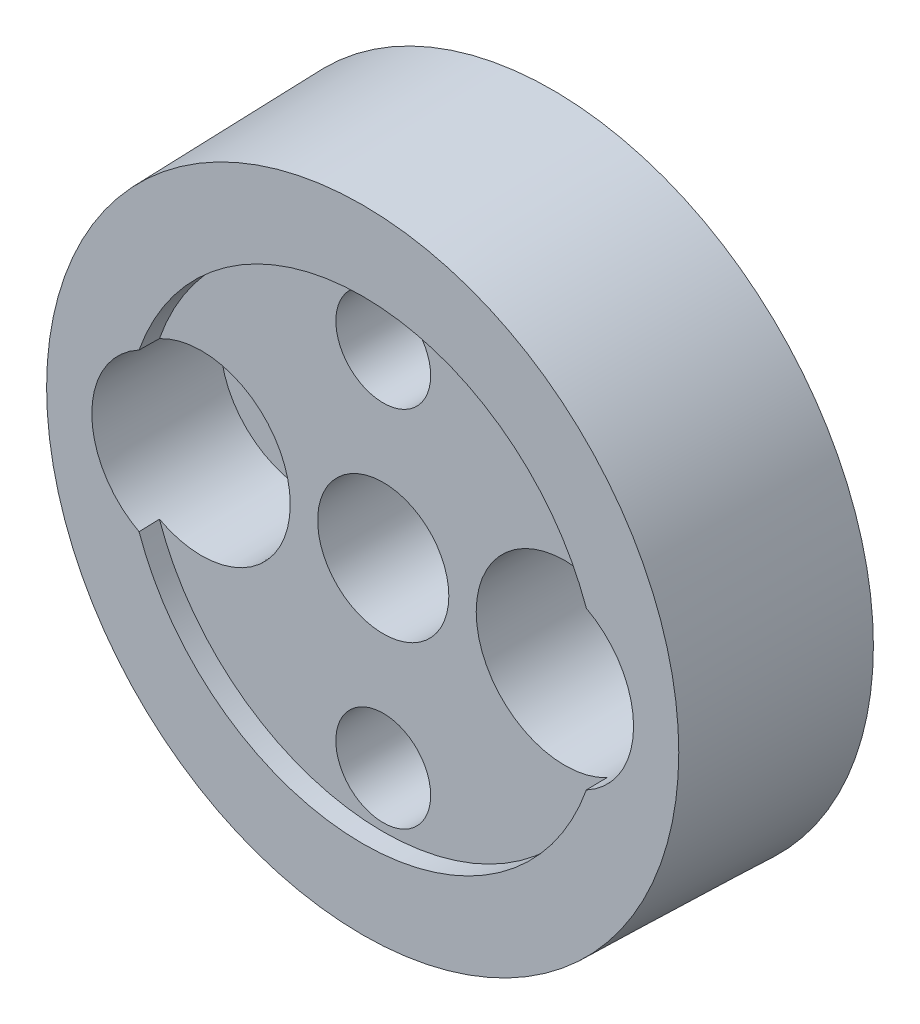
ISO-10303-21;
HEADER;
FILE_DESCRIPTION(('STEP AP214'),'2;1');
FILE_NAME('part.step','',(''),(''),'','','');
FILE_SCHEMA(('AUTOMOTIVE_DESIGN { 1 0 10303 214 1 1 1 1 }'));
ENDSEC;
DATA;
#1=APPLICATION_CONTEXT('core data for automotive mechanical design processes');
#2=APPLICATION_PROTOCOL_DEFINITION('international standard','automotive_design',2000,#1);
#3=PRODUCT_CONTEXT('',#1,'mechanical');
#4=PRODUCT('Part','Part','',(#3));
#5=PRODUCT_RELATED_PRODUCT_CATEGORY('part','',(#4));
#6=PRODUCT_DEFINITION_FORMATION('','',#4);
#7=PRODUCT_DEFINITION_CONTEXT('part definition',#1,'design');
#8=PRODUCT_DEFINITION('design','',#6,#7);
#9=PRODUCT_DEFINITION_SHAPE('','',#8);
#10=(LENGTH_UNIT() NAMED_UNIT(*) SI_UNIT(.MILLI.,.METRE.));
#11=(NAMED_UNIT(*) PLANE_ANGLE_UNIT() SI_UNIT($,.RADIAN.));
#12=(NAMED_UNIT(*) SI_UNIT($,.STERADIAN.) SOLID_ANGLE_UNIT());
#13=UNCERTAINTY_MEASURE_WITH_UNIT(LENGTH_MEASURE(1.E-05),#10,'distance_accuracy_value','');
#14=(GEOMETRIC_REPRESENTATION_CONTEXT(3) GLOBAL_UNCERTAINTY_ASSIGNED_CONTEXT((#13)) GLOBAL_UNIT_ASSIGNED_CONTEXT((#10,
#11,#12)) REPRESENTATION_CONTEXT('',''));
#15=CARTESIAN_POINT('',(0.,0.,0.));
#16=DIRECTION('',(0.,0.,1.));
#17=DIRECTION('',(1.,0.,0.));
#18=AXIS2_PLACEMENT_3D('',#15,#16,#17);
#19=CARTESIAN_POINT('',(0.,0.,12.));
#20=DIRECTION('',(0.,0.,1.));
#21=DIRECTION('',(1.,0.,0.));
#22=AXIS2_PLACEMENT_3D('',#19,#20,#21);
#23=CYLINDRICAL_SURFACE('',#22,15.);
#24=CARTESIAN_POINT('',(0.,0.,12.));
#25=DIRECTION('',(0.,0.,1.));
#26=DIRECTION('',(1.,0.,0.));
#27=AXIS2_PLACEMENT_3D('',#24,#25,#26);
#28=CIRCLE('',#27,15.);
#29=CARTESIAN_POINT('',(-14.1497589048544,-4.97838557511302,12.));
#30=VERTEX_POINT('',#29);
#31=CARTESIAN_POINT('',(14.1497589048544,-4.97838557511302,12.));
#32=VERTEX_POINT('',#31);
#33=EDGE_CURVE('E59',#30,#32,#28,.T.);
#34=ORIENTED_EDGE('',*,*,#33,.T.);
#35=CARTESIAN_POINT('',(14.14970155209,-4.97854858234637,12.0067));
#36=CARTESIAN_POINT('',(14.1515753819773,-4.97322292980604,11.7877998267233));
#37=CARTESIAN_POINT('',(14.1534473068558,-4.9678930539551,11.5688997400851));
#38=CARTESIAN_POINT('',(14.1571873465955,-4.95722485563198,11.1310997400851));
#39=CARTESIAN_POINT('',(14.1590554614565,-4.95188653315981,10.9121998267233));
#40=CARTESIAN_POINT('',(14.1609216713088,-4.94654398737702,10.6933));
#41=B_SPLINE_CURVE_WITH_KNOTS('',3,(#35,#36,#37,#38,#39,#40),.UNSPECIFIED.,.F.,.F.,(4,2,4),(0.,
0.656918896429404,1.31383779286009),.UNSPECIFIED.);
#42=CARTESIAN_POINT('',(14.1608645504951,-4.94670750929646,10.7));
#43=VERTEX_POINT('',#42);
#44=EDGE_CURVE('E68',#32,#43,#41,.T.);
#45=ORIENTED_EDGE('',*,*,#44,.T.);
#46=CARTESIAN_POINT('',(0.,0.,10.7));
#47=DIRECTION('',(0.,0.,1.));
#48=DIRECTION('',(1.,0.,0.));
#49=AXIS2_PLACEMENT_3D('',#46,#47,#48);
#50=CIRCLE('',#49,15.);
#51=CARTESIAN_POINT('',(-14.1608645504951,-4.94670750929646,10.7));
#52=VERTEX_POINT('',#51);
#53=EDGE_CURVE('E58',#52,#43,#50,.T.);
#54=ORIENTED_EDGE('',*,*,#53,.F.);
#55=CARTESIAN_POINT('',(-14.1609216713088,-4.94654398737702,10.6933));
#56=CARTESIAN_POINT('',(-14.1590554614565,-4.95188653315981,10.9121998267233));
#57=CARTESIAN_POINT('',(-14.1571873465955,-4.95722485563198,11.1310997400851));
#58=CARTESIAN_POINT('',(-14.1534473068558,-4.9678930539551,11.5688997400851));
#59=CARTESIAN_POINT('',(-14.1515753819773,-4.97322292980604,11.7877998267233));
#60=CARTESIAN_POINT('',(-14.14970155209,-4.97854858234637,12.0067));
#61=B_SPLINE_CURVE_WITH_KNOTS('',3,(#55,#56,#57,#58,#59,#60),.UNSPECIFIED.,.F.,.F.,(4,2,4),(0.,
0.656918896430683,1.31383779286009),.UNSPECIFIED.);
#62=EDGE_CURVE('E115',#52,#30,#61,.T.);
#63=ORIENTED_EDGE('',*,*,#62,.T.);
#64=EDGE_LOOP('',(#34,#45,#54,#63));
#65=FACE_BOUND('',#64,.T.);
#66=ADVANCED_FACE('F14',(#65),#23,.F.);
#67=CARTESIAN_POINT('',(14.1497589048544,4.97838557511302,12.));
#68=VERTEX_POINT('',#67);
#69=CARTESIAN_POINT('',(-14.1497589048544,4.97838557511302,12.));
#70=VERTEX_POINT('',#69);
#71=EDGE_CURVE('E51',#68,#70,#28,.T.);
#72=ORIENTED_EDGE('',*,*,#71,.T.);
#73=CARTESIAN_POINT('',(-14.14970155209,4.97854858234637,12.0067));
#74=CARTESIAN_POINT('',(-14.1515753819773,4.97322292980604,11.7877998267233));
#75=CARTESIAN_POINT('',(-14.1534473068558,4.9678930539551,11.5688997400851));
#76=CARTESIAN_POINT('',(-14.1571873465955,4.95722485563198,11.1310997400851));
#77=CARTESIAN_POINT('',(-14.1590554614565,4.95188653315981,10.9121998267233));
#78=CARTESIAN_POINT('',(-14.1609216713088,4.94654398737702,10.6933));
#79=B_SPLINE_CURVE_WITH_KNOTS('',3,(#73,#74,#75,#76,#77,#78),.UNSPECIFIED.,.F.,.F.,(4,2,4),(0.,
0.656918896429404,1.31383779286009),.UNSPECIFIED.);
#80=CARTESIAN_POINT('',(-14.1608645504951,4.94670750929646,10.7));
#81=VERTEX_POINT('',#80);
#82=EDGE_CURVE('E29',#70,#81,#79,.T.);
#83=ORIENTED_EDGE('',*,*,#82,.T.);
#84=CARTESIAN_POINT('',(14.1608645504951,4.94670750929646,10.7));
#85=VERTEX_POINT('',#84);
#86=EDGE_CURVE('E72',#85,#81,#50,.T.);
#87=ORIENTED_EDGE('',*,*,#86,.F.);
#88=CARTESIAN_POINT('',(14.1609216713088,4.94654398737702,10.6933));
#89=CARTESIAN_POINT('',(14.1590554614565,4.95188653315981,10.9121998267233));
#90=CARTESIAN_POINT('',(14.1571873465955,4.95722485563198,11.1310997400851));
#91=CARTESIAN_POINT('',(14.1534473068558,4.9678930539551,11.5688997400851));
#92=CARTESIAN_POINT('',(14.1515753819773,4.97322292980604,11.7877998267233));
#93=CARTESIAN_POINT('',(14.14970155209,4.97854858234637,12.0067));
#94=B_SPLINE_CURVE_WITH_KNOTS('',3,(#88,#89,#90,#91,#92,#93),.UNSPECIFIED.,.F.,.F.,(4,2,4),(0.,
0.656918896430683,1.31383779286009),.UNSPECIFIED.);
#95=EDGE_CURVE('E65',#85,#68,#94,.T.);
#96=ORIENTED_EDGE('',*,*,#95,.T.);
#97=EDGE_LOOP('',(#72,#83,#87,#96));
#98=FACE_BOUND('',#97,.T.);
#99=ADVANCED_FACE('F70',(#98),#23,.F.);
#100=CARTESIAN_POINT('',(0.,20.3142310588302,0.));
#101=DIRECTION('',(0.,0.,-1.));
#102=DIRECTION('',(-1.,0.,0.));
#103=AXIS2_PLACEMENT_3D('',#100,#101,#102);
#104=PLANE('',#103);
#105=CARTESIAN_POINT('',(0.,0.,0.));
#106=DIRECTION('',(0.,0.,1.));
#107=DIRECTION('',(1.,0.,0.));
#108=AXIS2_PLACEMENT_3D('',#105,#106,#107);
#109=CIRCLE('',#108,4.15);
#110=CARTESIAN_POINT('',(4.15,0.,0.));
#111=VERTEX_POINT('',#110);
#112=EDGE_CURVE('E144',#111,#111,#109,.T.);
#113=ORIENTED_EDGE('',*,*,#112,.T.);
#114=EDGE_LOOP('',(#113));
#115=FACE_BOUND('',#114,.T.);
#116=CARTESIAN_POINT('',(0.,11.5,0.));
#117=DIRECTION('',(0.,0.,1.));
#118=DIRECTION('',(1.,0.,0.));
#119=AXIS2_PLACEMENT_3D('',#116,#117,#118);
#120=CIRCLE('',#119,3.);
#121=CARTESIAN_POINT('',(3.,11.5,0.));
#122=VERTEX_POINT('',#121);
#123=EDGE_CURVE('E131',#122,#122,#120,.T.);
#124=ORIENTED_EDGE('',*,*,#123,.T.);
#125=EDGE_LOOP('',(#124));
#126=FACE_BOUND('',#125,.T.);
#127=CARTESIAN_POINT('',(11.5,0.,0.));
#128=DIRECTION('',(0.,0.,1.));
#129=DIRECTION('',(1.,0.,0.));
#130=AXIS2_PLACEMENT_3D('',#127,#128,#129);
#131=CIRCLE('',#130,3.00008569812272);
#132=CARTESIAN_POINT('',(14.5000856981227,0.,0.));
#133=VERTEX_POINT('',#132);
#134=EDGE_CURVE('E73',#133,#133,#131,.T.);
#135=ORIENTED_EDGE('',*,*,#134,.T.);
#136=EDGE_LOOP('',(#135));
#137=FACE_BOUND('',#136,.T.);
#138=CARTESIAN_POINT('',(-11.5,0.,0.));
#139=DIRECTION('',(0.,0.,1.));
#140=DIRECTION('',(1.,0.,0.));
#141=AXIS2_PLACEMENT_3D('',#138,#139,#140);
#142=CIRCLE('',#141,3.00008569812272);
#143=CARTESIAN_POINT('',(-8.49991430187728,0.,0.));
#144=VERTEX_POINT('',#143);
#145=EDGE_CURVE('E191',#144,#144,#142,.T.);
#146=ORIENTED_EDGE('',*,*,#145,.T.);
#147=EDGE_LOOP('',(#146));
#148=FACE_BOUND('',#147,.T.);
#149=CARTESIAN_POINT('',(0.,-11.5,0.));
#150=DIRECTION('',(0.,0.,1.));
#151=DIRECTION('',(1.,0.,0.));
#152=AXIS2_PLACEMENT_3D('',#149,#150,#151);
#153=CIRCLE('',#152,3.);
#154=CARTESIAN_POINT('',(3.,-11.5,0.));
#155=VERTEX_POINT('',#154);
#156=EDGE_CURVE('E128',#155,#155,#153,.T.);
#157=ORIENTED_EDGE('',*,*,#156,.T.);
#158=EDGE_LOOP('',(#157));
#159=FACE_BOUND('',#158,.T.);
#160=CARTESIAN_POINT('',(0.,0.,0.));
#161=DIRECTION('',(0.,0.,1.));
#162=DIRECTION('',(1.,0.,0.));
#163=AXIS2_PLACEMENT_3D('',#160,#161,#162);
#164=CIRCLE('',#163,20.3142310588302);
#165=CARTESIAN_POINT('',(20.3142310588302,0.,0.));
#166=VERTEX_POINT('',#165);
#167=EDGE_CURVE('E134',#166,#166,#164,.T.);
#168=ORIENTED_EDGE('',*,*,#167,.F.);
#169=EDGE_LOOP('',(#168));
#170=FACE_BOUND('',#169,.T.);
#171=ADVANCED_FACE('F16',(#115,#126,#137,#148,#159,#170),#104,.T.);
#172=CARTESIAN_POINT('',(0.,0.,12.));
#173=DIRECTION('',(0.,0.,1.));
#174=DIRECTION('',(1.,0.,0.));
#175=AXIS2_PLACEMENT_3D('',#172,#173,#174);
#176=CYLINDRICAL_SURFACE('',#175,4.15);
#177=CARTESIAN_POINT('',(0.,0.,10.7));
#178=DIRECTION('',(0.,0.,1.));
#179=DIRECTION('',(1.,0.,0.));
#180=AXIS2_PLACEMENT_3D('',#177,#178,#179);
#181=CIRCLE('',#180,4.15);
#182=CARTESIAN_POINT('',(4.15,0.,10.7));
#183=VERTEX_POINT('',#182);
#184=EDGE_CURVE('E141',#183,#183,#181,.T.);
#185=ORIENTED_EDGE('',*,*,#184,.T.);
#186=EDGE_LOOP('',(#185));
#187=FACE_BOUND('',#186,.T.);
#188=ORIENTED_EDGE('',*,*,#112,.F.);
#189=EDGE_LOOP('',(#188));
#190=FACE_BOUND('',#189,.T.);
#191=ADVANCED_FACE('F167',(#187,#190),#176,.F.);
#192=CARTESIAN_POINT('',(0.,4.15,10.7));
#193=DIRECTION('',(0.,0.,1.));
#194=DIRECTION('',(1.,0.,0.));
#195=AXIS2_PLACEMENT_3D('',#192,#193,#194);
#196=PLANE('',#195);
#197=CARTESIAN_POINT('',(11.5,0.,10.7));
#198=DIRECTION('',(0.,0.,1.));
#199=DIRECTION('',(1.,0.,0.));
#200=AXIS2_PLACEMENT_3D('',#197,#198,#199);
#201=CIRCLE('',#200,5.61694893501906);
#202=EDGE_CURVE('E75',#43,#85,#201,.F.);
#203=ORIENTED_EDGE('',*,*,#202,.T.);
#204=ORIENTED_EDGE('',*,*,#86,.T.);
#205=CARTESIAN_POINT('',(-11.5,0.,10.7));
#206=DIRECTION('',(0.,0.,1.));
#207=DIRECTION('',(1.,0.,0.));
#208=AXIS2_PLACEMENT_3D('',#205,#206,#207);
#209=CIRCLE('',#208,5.61694893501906);
#210=EDGE_CURVE('E34',#81,#52,#209,.F.);
#211=ORIENTED_EDGE('',*,*,#210,.T.);
#212=ORIENTED_EDGE('',*,*,#53,.T.);
#213=EDGE_LOOP('',(#203,#204,#211,#212));
#214=FACE_BOUND('',#213,.T.);
#215=CARTESIAN_POINT('',(0.,11.5,10.7));
#216=DIRECTION('',(0.,0.,1.));
#217=DIRECTION('',(1.,0.,0.));
#218=AXIS2_PLACEMENT_3D('',#215,#216,#217);
#219=CIRCLE('',#218,3.);
#220=CARTESIAN_POINT('',(3.,11.5,10.7));
#221=VERTEX_POINT('',#220);
#222=EDGE_CURVE('E147',#221,#221,#219,.F.);
#223=ORIENTED_EDGE('',*,*,#222,.T.);
#224=EDGE_LOOP('',(#223));
#225=FACE_BOUND('',#224,.T.);
#226=CARTESIAN_POINT('',(0.,-11.5,10.7));
#227=DIRECTION('',(0.,0.,1.));
#228=DIRECTION('',(1.,0.,0.));
#229=AXIS2_PLACEMENT_3D('',#226,#227,#228);
#230=CIRCLE('',#229,3.);
#231=CARTESIAN_POINT('',(3.,-11.5,10.7));
#232=VERTEX_POINT('',#231);
#233=EDGE_CURVE('E150',#232,#232,#230,.F.);
#234=ORIENTED_EDGE('',*,*,#233,.T.);
#235=EDGE_LOOP('',(#234));
#236=FACE_BOUND('',#235,.T.);
#237=ORIENTED_EDGE('',*,*,#184,.F.);
#238=EDGE_LOOP('',(#237));
#239=FACE_BOUND('',#238,.T.);
#240=ADVANCED_FACE('F154',(#214,#225,#236,#239),#196,.T.);
#241=CARTESIAN_POINT('',(0.,15.,12.));
#242=DIRECTION('',(0.,0.,1.));
#243=DIRECTION('',(1.,0.,0.));
#244=AXIS2_PLACEMENT_3D('',#241,#242,#243);
#245=PLANE('',#244);
#246=CARTESIAN_POINT('',(0.,0.,12.));
#247=DIRECTION('',(0.,0.,1.));
#248=DIRECTION('',(1.,0.,0.));
#249=AXIS2_PLACEMENT_3D('',#246,#247,#248);
#250=CIRCLE('',#249,20.);
#251=CARTESIAN_POINT('',(20.,0.,12.));
#252=VERTEX_POINT('',#251);
#253=EDGE_CURVE('E137',#252,#252,#250,.T.);
#254=ORIENTED_EDGE('',*,*,#253,.T.);
#255=EDGE_LOOP('',(#254));
#256=FACE_BOUND('',#255,.T.);
#257=CARTESIAN_POINT('',(11.5,0.,12.));
#258=DIRECTION('',(0.,0.,1.));
#259=DIRECTION('',(1.,0.,0.));
#260=AXIS2_PLACEMENT_3D('',#257,#258,#259);
#261=CIRCLE('',#260,5.63964051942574);
#262=EDGE_CURVE('E9',#68,#32,#261,.F.);
#263=ORIENTED_EDGE('',*,*,#262,.T.);
#264=ORIENTED_EDGE('',*,*,#33,.F.);
#265=CARTESIAN_POINT('',(-11.5,0.,12.));
#266=DIRECTION('',(0.,0.,1.));
#267=DIRECTION('',(1.,0.,0.));
#268=AXIS2_PLACEMENT_3D('',#265,#266,#267);
#269=CIRCLE('',#268,5.63964051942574);
#270=EDGE_CURVE('E22',#30,#70,#269,.F.);
#271=ORIENTED_EDGE('',*,*,#270,.T.);
#272=ORIENTED_EDGE('',*,*,#71,.F.);
#273=EDGE_LOOP('',(#263,#264,#271,#272));
#274=FACE_BOUND('',#273,.T.);
#275=ADVANCED_FACE('F53',(#256,#274),#245,.T.);
#276=CARTESIAN_POINT('',(0.,0.,12.));
#277=DIRECTION('',(0.,0.,-1.));
#278=DIRECTION('',(-1.,0.,0.));
#279=AXIS2_PLACEMENT_3D('',#276,#277,#278);
#280=CONICAL_SURFACE('',#279,20.,0.026179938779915);
#281=ORIENTED_EDGE('',*,*,#167,.T.);
#282=EDGE_LOOP('',(#281));
#283=FACE_BOUND('',#282,.T.);
#284=ORIENTED_EDGE('',*,*,#253,.F.);
#285=EDGE_LOOP('',(#284));
#286=FACE_BOUND('',#285,.T.);
#287=ADVANCED_FACE('F171',(#283,#286),#280,.T.);
#288=CARTESIAN_POINT('',(0.,11.5,22.8));
#289=DIRECTION('',(0.,0.,1.));
#290=DIRECTION('',(1.,0.,0.));
#291=AXIS2_PLACEMENT_3D('',#288,#289,#290);
#292=CYLINDRICAL_SURFACE('',#291,3.);
#293=ORIENTED_EDGE('',*,*,#222,.F.);
#294=EDGE_LOOP('',(#293));
#295=FACE_BOUND('',#294,.T.);
#296=ORIENTED_EDGE('',*,*,#123,.F.);
#297=EDGE_LOOP('',(#296));
#298=FACE_BOUND('',#297,.T.);
#299=ADVANCED_FACE('F161',(#295,#298),#292,.F.);
#300=CARTESIAN_POINT('',(0.,-11.5,22.8));
#301=DIRECTION('',(0.,0.,1.));
#302=DIRECTION('',(1.,0.,0.));
#303=AXIS2_PLACEMENT_3D('',#300,#301,#302);
#304=CYLINDRICAL_SURFACE('',#303,3.);
#305=ORIENTED_EDGE('',*,*,#233,.F.);
#306=EDGE_LOOP('',(#305));
#307=FACE_BOUND('',#306,.T.);
#308=ORIENTED_EDGE('',*,*,#156,.F.);
#309=EDGE_LOOP('',(#308));
#310=FACE_BOUND('',#309,.T.);
#311=ADVANCED_FACE('F157',(#307,#310),#304,.F.);
#312=CARTESIAN_POINT('',(-11.5,0.,0.));
#313=DIRECTION('',(0.,0.,1.));
#314=DIRECTION('',(1.,0.,0.));
#315=AXIS2_PLACEMENT_3D('',#312,#313,#314);
#316=CONICAL_SURFACE('',#315,3.00008569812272,0.026179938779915);
#317=CARTESIAN_POINT('',(-11.5,0.,4.));
#318=DIRECTION('',(0.,0.,1.));
#319=DIRECTION('',(1.,0.,0.));
#320=AXIS2_PLACEMENT_3D('',#317,#318,#319);
#321=CIRCLE('',#320,3.10482938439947);
#322=CARTESIAN_POINT('',(-8.39517061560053,0.,4.));
#323=VERTEX_POINT('',#322);
#324=EDGE_CURVE('E193',#323,#323,#321,.T.);
#325=ORIENTED_EDGE('',*,*,#324,.T.);
#326=EDGE_LOOP('',(#325));
#327=FACE_BOUND('',#326,.T.);
#328=ORIENTED_EDGE('',*,*,#145,.F.);
#329=EDGE_LOOP('',(#328));
#330=FACE_BOUND('',#329,.T.);
#331=ADVANCED_FACE('F160',(#327,#330),#316,.F.);
#332=CARTESIAN_POINT('',(-8.39517061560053,0.,4.));
#333=DIRECTION('',(0.,0.,1.));
#334=DIRECTION('',(1.,0.,0.));
#335=AXIS2_PLACEMENT_3D('',#332,#333,#334);
#336=PLANE('',#335);
#337=CARTESIAN_POINT('',(-11.5,0.,4.));
#338=DIRECTION('',(0.,0.,1.));
#339=DIRECTION('',(1.,0.,0.));
#340=AXIS2_PLACEMENT_3D('',#337,#338,#339);
#341=CIRCLE('',#340,5.5);
#342=CARTESIAN_POINT('',(-6.,0.,4.));
#343=VERTEX_POINT('',#342);
#344=EDGE_CURVE('E197',#343,#343,#341,.T.);
#345=ORIENTED_EDGE('',*,*,#344,.T.);
#346=EDGE_LOOP('',(#345));
#347=FACE_BOUND('',#346,.T.);
#348=ORIENTED_EDGE('',*,*,#324,.F.);
#349=EDGE_LOOP('',(#348));
#350=FACE_BOUND('',#349,.T.);
#351=ADVANCED_FACE('F111',(#347,#350),#336,.T.);
#352=CARTESIAN_POINT('',(-11.5,0.,4.));
#353=DIRECTION('',(0.,0.,1.));
#354=DIRECTION('',(1.,0.,0.));
#355=AXIS2_PLACEMENT_3D('',#352,#353,#354);
#356=CONICAL_SURFACE('',#355,5.5,0.0174532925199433);
#357=ORIENTED_EDGE('',*,*,#210,.F.);
#358=ORIENTED_EDGE('',*,*,#82,.F.);
#359=ORIENTED_EDGE('',*,*,#270,.F.);
#360=ORIENTED_EDGE('',*,*,#62,.F.);
#361=EDGE_LOOP('',(#357,#358,#359,#360));
#362=FACE_BOUND('',#361,.T.);
#363=ORIENTED_EDGE('',*,*,#344,.F.);
#364=EDGE_LOOP('',(#363));
#365=FACE_BOUND('',#364,.T.);
#366=ADVANCED_FACE('F106',(#362,#365),#356,.F.);
#367=CARTESIAN_POINT('',(11.5,0.,0.));
#368=DIRECTION('',(0.,0.,1.));
#369=DIRECTION('',(1.,0.,0.));
#370=AXIS2_PLACEMENT_3D('',#367,#368,#369);
#371=CONICAL_SURFACE('',#370,3.00008569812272,0.026179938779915);
#372=CARTESIAN_POINT('',(11.5,0.,4.));
#373=DIRECTION('',(0.,0.,1.));
#374=DIRECTION('',(1.,0.,0.));
#375=AXIS2_PLACEMENT_3D('',#372,#373,#374);
#376=CIRCLE('',#375,3.10482938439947);
#377=CARTESIAN_POINT('',(14.6048293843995,0.,4.));
#378=VERTEX_POINT('',#377);
#379=EDGE_CURVE('E78',#378,#378,#376,.T.);
#380=ORIENTED_EDGE('',*,*,#379,.T.);
#381=EDGE_LOOP('',(#380));
#382=FACE_BOUND('',#381,.T.);
#383=ORIENTED_EDGE('',*,*,#134,.F.);
#384=EDGE_LOOP('',(#383));
#385=FACE_BOUND('',#384,.T.);
#386=ADVANCED_FACE('F102',(#382,#385),#371,.F.);
#387=CARTESIAN_POINT('',(14.6048293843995,0.,4.));
#388=DIRECTION('',(0.,0.,1.));
#389=DIRECTION('',(1.,0.,0.));
#390=AXIS2_PLACEMENT_3D('',#387,#388,#389);
#391=PLANE('',#390);
#392=CARTESIAN_POINT('',(11.5,0.,4.));
#393=DIRECTION('',(0.,0.,1.));
#394=DIRECTION('',(1.,0.,0.));
#395=AXIS2_PLACEMENT_3D('',#392,#393,#394);
#396=CIRCLE('',#395,5.5);
#397=CARTESIAN_POINT('',(17.,0.,4.));
#398=VERTEX_POINT('',#397);
#399=EDGE_CURVE('E322',#398,#398,#396,.T.);
#400=ORIENTED_EDGE('',*,*,#399,.T.);
#401=EDGE_LOOP('',(#400));
#402=FACE_BOUND('',#401,.T.);
#403=ORIENTED_EDGE('',*,*,#379,.F.);
#404=EDGE_LOOP('',(#403));
#405=FACE_BOUND('',#404,.T.);
#406=ADVANCED_FACE('F98',(#402,#405),#391,.T.);
#407=CARTESIAN_POINT('',(11.5,0.,4.));
#408=DIRECTION('',(0.,0.,1.));
#409=DIRECTION('',(1.,0.,0.));
#410=AXIS2_PLACEMENT_3D('',#407,#408,#409);
#411=CONICAL_SURFACE('',#410,5.5,0.0174532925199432);
#412=ORIENTED_EDGE('',*,*,#44,.F.);
#413=ORIENTED_EDGE('',*,*,#262,.F.);
#414=ORIENTED_EDGE('',*,*,#95,.F.);
#415=ORIENTED_EDGE('',*,*,#202,.F.);
#416=EDGE_LOOP('',(#412,#413,#414,#415));
#417=FACE_BOUND('',#416,.T.);
#418=ORIENTED_EDGE('',*,*,#399,.F.);
#419=EDGE_LOOP('',(#418));
#420=FACE_BOUND('',#419,.T.);
#421=ADVANCED_FACE('F63',(#417,#420),#411,.F.);
#422=CLOSED_SHELL('',(#66,#99,#171,#191,#240,#275,#287,#299,#311,#331,#351,#366,#386,#406,#421));
#423=MANIFOLD_SOLID_BREP('B1',#422);
#424=ADVANCED_BREP_SHAPE_REPRESENTATION('',(#18,#423),#14);
#425=SHAPE_DEFINITION_REPRESENTATION(#9,#424);
ENDSEC;
END-ISO-10303-21;
